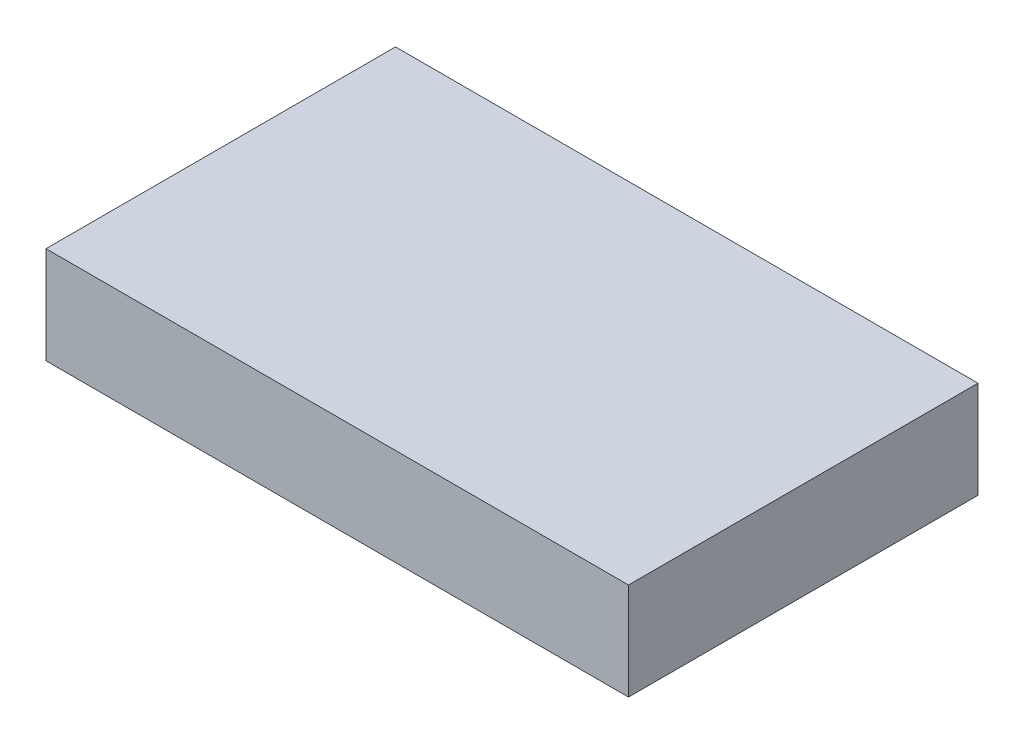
from build123d import *

# Parameters (mm, degrees)
SKETCH_1_W                        = 150
SKETCH_1_H                        = 25
V2_REF_ELECTRONICS_ENVELOPE_DEPTH = 90


with BuildPart() as part:
    # Sketch 1 → V2_REF_electronics_envelope (new body)
    with BuildSketch(Plane.XY):
        with Locations((75, 12.5)):
            Rectangle(SKETCH_1_W, SKETCH_1_H)
    extrude(amount=V2_REF_ELECTRONICS_ENVELOPE_DEPTH)


solid = part.part
